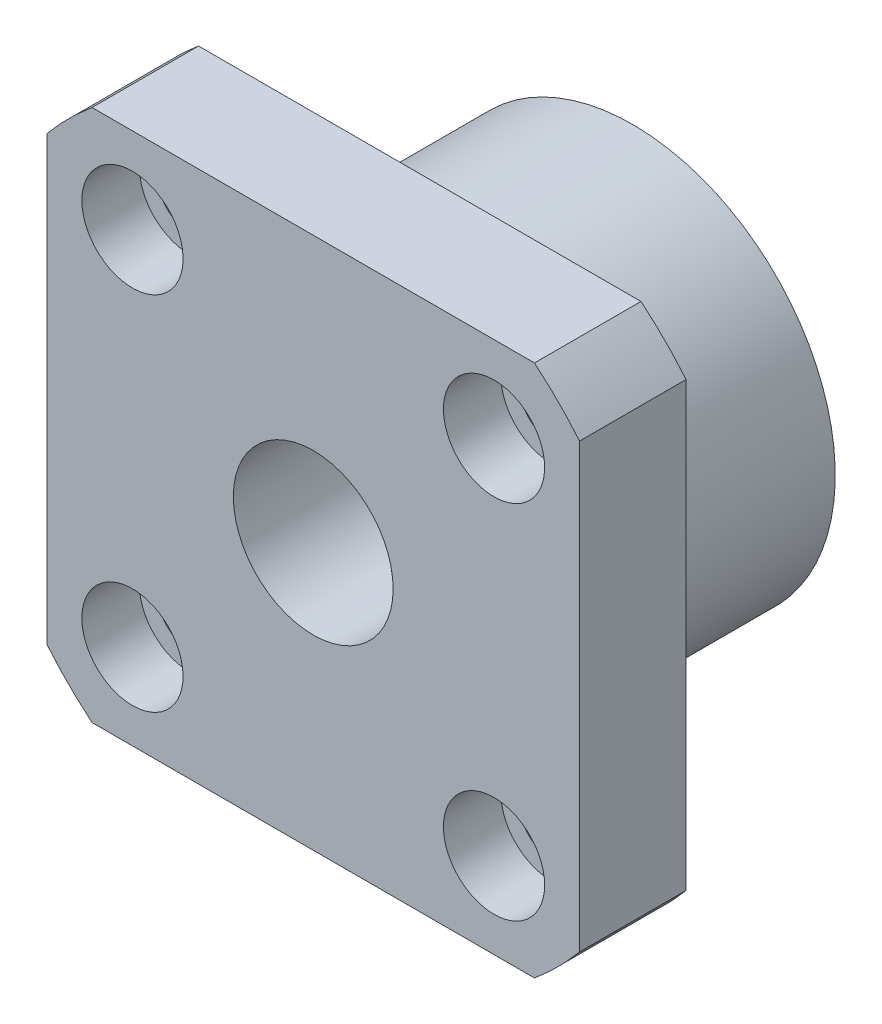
ISO-10303-21;
HEADER;
FILE_DESCRIPTION(('STEP AP214'),'2;1');
FILE_NAME('part.step','',(''),(''),'','','');
FILE_SCHEMA(('AUTOMOTIVE_DESIGN { 1 0 10303 214 1 1 1 1 }'));
ENDSEC;
DATA;
#1=APPLICATION_CONTEXT('core data for automotive mechanical design processes');
#2=APPLICATION_PROTOCOL_DEFINITION('international standard','automotive_design',2000,#1);
#3=PRODUCT_CONTEXT('',#1,'mechanical');
#4=PRODUCT('Part','Part','',(#3));
#5=PRODUCT_RELATED_PRODUCT_CATEGORY('part','',(#4));
#6=PRODUCT_DEFINITION_FORMATION('','',#4);
#7=PRODUCT_DEFINITION_CONTEXT('part definition',#1,'design');
#8=PRODUCT_DEFINITION('design','',#6,#7);
#9=PRODUCT_DEFINITION_SHAPE('','',#8);
#10=(LENGTH_UNIT() NAMED_UNIT(*) SI_UNIT(.MILLI.,.METRE.));
#11=(NAMED_UNIT(*) PLANE_ANGLE_UNIT() SI_UNIT($,.RADIAN.));
#12=(NAMED_UNIT(*) SI_UNIT($,.STERADIAN.) SOLID_ANGLE_UNIT());
#13=UNCERTAINTY_MEASURE_WITH_UNIT(LENGTH_MEASURE(1.E-05),#10,'distance_accuracy_value','');
#14=(GEOMETRIC_REPRESENTATION_CONTEXT(3) GLOBAL_UNCERTAINTY_ASSIGNED_CONTEXT((#13)) GLOBAL_UNIT_ASSIGNED_CONTEXT((#10,
#11,#12)) REPRESENTATION_CONTEXT('',''));
#15=CARTESIAN_POINT('',(0.,0.,0.));
#16=DIRECTION('',(0.,0.,1.));
#17=DIRECTION('',(1.,0.,0.));
#18=AXIS2_PLACEMENT_3D('',#15,#16,#17);
#19=CARTESIAN_POINT('',(0.,0.,0.));
#20=DIRECTION('',(0.,0.,-1.));
#21=DIRECTION('',(-1.,0.,0.));
#22=AXIS2_PLACEMENT_3D('',#19,#20,#21);
#23=PLANE('',#22);
#24=CARTESIAN_POINT('',(-16.9705627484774,-16.9705627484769,0.));
#25=DIRECTION('',(0.,0.,-1.));
#26=DIRECTION('',(0.,-1.,0.));
#27=AXIS2_PLACEMENT_3D('',#24,#25,#26);
#28=CIRCLE('',#27,3.);
#29=CARTESIAN_POINT('',(-16.9705627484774,-19.9705627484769,0.));
#30=VERTEX_POINT('',#29);
#31=EDGE_CURVE('E156',#30,#30,#28,.T.);
#32=ORIENTED_EDGE('',*,*,#31,.F.);
#33=EDGE_LOOP('',(#32));
#34=FACE_BOUND('',#33,.T.);
#35=CARTESIAN_POINT('',(16.9705627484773,16.970562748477,0.));
#36=DIRECTION('',(0.,0.,-1.));
#37=DIRECTION('',(0.,1.,0.));
#38=AXIS2_PLACEMENT_3D('',#35,#36,#37);
#39=CIRCLE('',#38,3.);
#40=CARTESIAN_POINT('',(16.9705627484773,19.970562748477,0.));
#41=VERTEX_POINT('',#40);
#42=EDGE_CURVE('E190',#41,#41,#39,.T.);
#43=ORIENTED_EDGE('',*,*,#42,.F.);
#44=EDGE_LOOP('',(#43));
#45=FACE_BOUND('',#44,.T.);
#46=CARTESIAN_POINT('',(0.,0.,0.));
#47=DIRECTION('',(0.,0.,-1.));
#48=DIRECTION('',(-1.,0.,0.));
#49=AXIS2_PLACEMENT_3D('',#46,#47,#48);
#50=CIRCLE('',#49,32.5);
#51=CARTESIAN_POINT('',(25.,-20.7665596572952,0.));
#52=VERTEX_POINT('',#51);
#53=CARTESIAN_POINT('',(20.7665596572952,-25.,0.));
#54=VERTEX_POINT('',#53);
#55=EDGE_CURVE('E80',#52,#54,#50,.T.);
#56=ORIENTED_EDGE('',*,*,#55,.T.);
#57=DIRECTION('',(1.,0.,0.));
#58=VECTOR('',#57,1.);
#59=CARTESIAN_POINT('',(-20.7665596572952,-25.,0.));
#60=LINE('',#59,#58);
#61=CARTESIAN_POINT('',(-20.7665596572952,-25.,0.));
#62=VERTEX_POINT('',#61);
#63=EDGE_CURVE('E94',#62,#54,#60,.T.);
#64=ORIENTED_EDGE('',*,*,#63,.F.);
#65=CARTESIAN_POINT('',(0.,0.,0.));
#66=DIRECTION('',(0.,0.,1.));
#67=DIRECTION('',(1.,0.,0.));
#68=AXIS2_PLACEMENT_3D('',#65,#66,#67);
#69=CIRCLE('',#68,32.5);
#70=CARTESIAN_POINT('',(-25.,-20.7665596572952,0.));
#71=VERTEX_POINT('',#70);
#72=EDGE_CURVE('E101',#71,#62,#69,.T.);
#73=ORIENTED_EDGE('',*,*,#72,.F.);
#74=DIRECTION('',(0.,-1.,0.));
#75=VECTOR('',#74,1.);
#76=CARTESIAN_POINT('',(-25.,20.7665596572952,0.));
#77=LINE('',#76,#75);
#78=CARTESIAN_POINT('',(-25.,20.7665596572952,0.));
#79=VERTEX_POINT('',#78);
#80=EDGE_CURVE('E103',#79,#71,#77,.T.);
#81=ORIENTED_EDGE('',*,*,#80,.F.);
#82=CARTESIAN_POINT('',(0.,0.,0.));
#83=DIRECTION('',(0.,0.,-1.));
#84=DIRECTION('',(-1.,0.,0.));
#85=AXIS2_PLACEMENT_3D('',#82,#83,#84);
#86=CIRCLE('',#85,32.5);
#87=CARTESIAN_POINT('',(-20.7665596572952,25.,0.));
#88=VERTEX_POINT('',#87);
#89=EDGE_CURVE('E109',#79,#88,#86,.T.);
#90=ORIENTED_EDGE('',*,*,#89,.T.);
#91=DIRECTION('',(1.,0.,0.));
#92=VECTOR('',#91,1.);
#93=CARTESIAN_POINT('',(-20.7665596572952,25.,0.));
#94=LINE('',#93,#92);
#95=CARTESIAN_POINT('',(20.7665596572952,25.,0.));
#96=VERTEX_POINT('',#95);
#97=EDGE_CURVE('E112',#88,#96,#94,.T.);
#98=ORIENTED_EDGE('',*,*,#97,.T.);
#99=CARTESIAN_POINT('',(0.,0.,0.));
#100=DIRECTION('',(0.,0.,1.));
#101=DIRECTION('',(1.,0.,0.));
#102=AXIS2_PLACEMENT_3D('',#99,#100,#101);
#103=CIRCLE('',#102,32.5);
#104=CARTESIAN_POINT('',(25.,20.7665596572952,0.));
#105=VERTEX_POINT('',#104);
#106=EDGE_CURVE('E115',#105,#96,#103,.T.);
#107=ORIENTED_EDGE('',*,*,#106,.F.);
#108=DIRECTION('',(0.,-1.,0.));
#109=VECTOR('',#108,1.);
#110=CARTESIAN_POINT('',(25.,20.7665596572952,0.));
#111=LINE('',#110,#109);
#112=EDGE_CURVE('E97',#105,#52,#111,.T.);
#113=ORIENTED_EDGE('',*,*,#112,.T.);
#114=EDGE_LOOP('',(#56,#64,#73,#81,#90,#98,#107,#113));
#115=FACE_BOUND('',#114,.T.);
#116=CARTESIAN_POINT('',(-16.9705627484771,16.9705627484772,0.));
#117=DIRECTION('',(0.,0.,-1.));
#118=DIRECTION('',(-1.,0.,0.));
#119=AXIS2_PLACEMENT_3D('',#116,#117,#118);
#120=CIRCLE('',#119,3.);
#121=CARTESIAN_POINT('',(-19.970562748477,16.9705627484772,0.));
#122=VERTEX_POINT('',#121);
#123=EDGE_CURVE('E151',#122,#122,#120,.T.);
#124=ORIENTED_EDGE('',*,*,#123,.F.);
#125=EDGE_LOOP('',(#124));
#126=FACE_BOUND('',#125,.T.);
#127=CARTESIAN_POINT('',(16.9705627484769,-16.9705627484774,0.));
#128=DIRECTION('',(0.,0.,-1.));
#129=DIRECTION('',(1.,0.,0.));
#130=AXIS2_PLACEMENT_3D('',#127,#128,#129);
#131=CIRCLE('',#130,3.);
#132=CARTESIAN_POINT('',(19.9705627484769,-16.9705627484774,0.));
#133=VERTEX_POINT('',#132);
#134=EDGE_CURVE('E187',#133,#133,#131,.T.);
#135=ORIENTED_EDGE('',*,*,#134,.F.);
#136=EDGE_LOOP('',(#135));
#137=FACE_BOUND('',#136,.T.);
#138=CARTESIAN_POINT('',(0.,0.,0.));
#139=DIRECTION('',(0.,0.,-1.));
#140=DIRECTION('',(-1.,0.,0.));
#141=AXIS2_PLACEMENT_3D('',#138,#139,#140);
#142=CIRCLE('',#141,19.);
#143=CARTESIAN_POINT('',(-19.,0.,0.));
#144=VERTEX_POINT('',#143);
#145=EDGE_CURVE('E18',#144,#144,#142,.F.);
#146=ORIENTED_EDGE('',*,*,#145,.T.);
#147=EDGE_LOOP('',(#146));
#148=FACE_BOUND('',#147,.T.);
#149=ADVANCED_FACE('F14',(#34,#45,#115,#126,#137,#148),#23,.T.);
#150=CARTESIAN_POINT('',(0.,0.,10.));
#151=DIRECTION('',(0.,0.,-1.));
#152=DIRECTION('',(-1.,0.,0.));
#153=AXIS2_PLACEMENT_3D('',#150,#151,#152);
#154=PLANE('',#153);
#155=CARTESIAN_POINT('',(0.,0.,10.));
#156=DIRECTION('',(0.,0.,1.));
#157=DIRECTION('',(1.,0.,0.));
#158=AXIS2_PLACEMENT_3D('',#155,#156,#157);
#159=CIRCLE('',#158,7.5);
#160=CARTESIAN_POINT('',(7.5,0.,10.));
#161=VERTEX_POINT('',#160);
#162=EDGE_CURVE('E98',#161,#161,#159,.T.);
#163=ORIENTED_EDGE('',*,*,#162,.F.);
#164=EDGE_LOOP('',(#163));
#165=FACE_BOUND('',#164,.T.);
#166=CARTESIAN_POINT('',(-16.9705627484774,-16.9705627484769,10.));
#167=DIRECTION('',(0.,0.,-1.));
#168=DIRECTION('',(0.,-1.,0.));
#169=AXIS2_PLACEMENT_3D('',#166,#167,#168);
#170=CIRCLE('',#169,4.75);
#171=CARTESIAN_POINT('',(-16.9705627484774,-21.7205627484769,10.));
#172=VERTEX_POINT('',#171);
#173=EDGE_CURVE('E171',#172,#172,#170,.T.);
#174=ORIENTED_EDGE('',*,*,#173,.T.);
#175=EDGE_LOOP('',(#174));
#176=FACE_BOUND('',#175,.T.);
#177=CARTESIAN_POINT('',(16.9705627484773,16.970562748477,10.));
#178=DIRECTION('',(0.,0.,-1.));
#179=DIRECTION('',(0.,1.,0.));
#180=AXIS2_PLACEMENT_3D('',#177,#178,#179);
#181=CIRCLE('',#180,4.75);
#182=CARTESIAN_POINT('',(16.9705627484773,21.720562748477,10.));
#183=VERTEX_POINT('',#182);
#184=EDGE_CURVE('E160',#183,#183,#181,.T.);
#185=ORIENTED_EDGE('',*,*,#184,.T.);
#186=EDGE_LOOP('',(#185));
#187=FACE_BOUND('',#186,.T.);
#188=CARTESIAN_POINT('',(-16.9705627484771,16.9705627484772,10.));
#189=DIRECTION('',(0.,0.,-1.));
#190=DIRECTION('',(-1.,0.,0.));
#191=AXIS2_PLACEMENT_3D('',#188,#189,#190);
#192=CIRCLE('',#191,4.75);
#193=CARTESIAN_POINT('',(-21.7205627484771,16.9705627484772,10.));
#194=VERTEX_POINT('',#193);
#195=EDGE_CURVE('E193',#194,#194,#192,.T.);
#196=ORIENTED_EDGE('',*,*,#195,.T.);
#197=EDGE_LOOP('',(#196));
#198=FACE_BOUND('',#197,.T.);
#199=CARTESIAN_POINT('',(0.,0.,10.));
#200=DIRECTION('',(0.,0.,-1.));
#201=DIRECTION('',(-1.,0.,0.));
#202=AXIS2_PLACEMENT_3D('',#199,#200,#201);
#203=CIRCLE('',#202,32.5);
#204=CARTESIAN_POINT('',(25.,-20.7665596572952,10.));
#205=VERTEX_POINT('',#204);
#206=CARTESIAN_POINT('',(20.7665596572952,-25.,10.));
#207=VERTEX_POINT('',#206);
#208=EDGE_CURVE('E82',#205,#207,#203,.T.);
#209=ORIENTED_EDGE('',*,*,#208,.F.);
#210=DIRECTION('',(0.,-1.,0.));
#211=VECTOR('',#210,1.);
#212=CARTESIAN_POINT('',(25.,20.7665596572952,10.));
#213=LINE('',#212,#211);
#214=CARTESIAN_POINT('',(25.,20.7665596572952,10.));
#215=VERTEX_POINT('',#214);
#216=EDGE_CURVE('E88',#215,#205,#213,.T.);
#217=ORIENTED_EDGE('',*,*,#216,.F.);
#218=CARTESIAN_POINT('',(0.,0.,10.));
#219=DIRECTION('',(0.,0.,1.));
#220=DIRECTION('',(1.,0.,0.));
#221=AXIS2_PLACEMENT_3D('',#218,#219,#220);
#222=CIRCLE('',#221,32.5);
#223=CARTESIAN_POINT('',(20.7665596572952,25.,10.));
#224=VERTEX_POINT('',#223);
#225=EDGE_CURVE('E134',#215,#224,#222,.T.);
#226=ORIENTED_EDGE('',*,*,#225,.T.);
#227=DIRECTION('',(1.,0.,0.));
#228=VECTOR('',#227,1.);
#229=CARTESIAN_POINT('',(-20.7665596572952,25.,10.));
#230=LINE('',#229,#228);
#231=CARTESIAN_POINT('',(-20.7665596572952,25.,10.));
#232=VERTEX_POINT('',#231);
#233=EDGE_CURVE('E131',#232,#224,#230,.T.);
#234=ORIENTED_EDGE('',*,*,#233,.F.);
#235=CARTESIAN_POINT('',(0.,0.,10.));
#236=DIRECTION('',(0.,0.,-1.));
#237=DIRECTION('',(-1.,0.,0.));
#238=AXIS2_PLACEMENT_3D('',#235,#236,#237);
#239=CIRCLE('',#238,32.5);
#240=CARTESIAN_POINT('',(-25.,20.7665596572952,10.));
#241=VERTEX_POINT('',#240);
#242=EDGE_CURVE('E128',#241,#232,#239,.T.);
#243=ORIENTED_EDGE('',*,*,#242,.F.);
#244=DIRECTION('',(0.,-1.,0.));
#245=VECTOR('',#244,1.);
#246=CARTESIAN_POINT('',(-25.,20.7665596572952,10.));
#247=LINE('',#246,#245);
#248=CARTESIAN_POINT('',(-25.,-20.7665596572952,10.));
#249=VERTEX_POINT('',#248);
#250=EDGE_CURVE('E125',#241,#249,#247,.T.);
#251=ORIENTED_EDGE('',*,*,#250,.T.);
#252=CARTESIAN_POINT('',(0.,0.,10.));
#253=DIRECTION('',(0.,0.,1.));
#254=DIRECTION('',(1.,0.,0.));
#255=AXIS2_PLACEMENT_3D('',#252,#253,#254);
#256=CIRCLE('',#255,32.5);
#257=CARTESIAN_POINT('',(-20.7665596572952,-25.,10.));
#258=VERTEX_POINT('',#257);
#259=EDGE_CURVE('E122',#249,#258,#256,.T.);
#260=ORIENTED_EDGE('',*,*,#259,.T.);
#261=DIRECTION('',(1.,0.,0.));
#262=VECTOR('',#261,1.);
#263=CARTESIAN_POINT('',(-20.7665596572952,-25.,10.));
#264=LINE('',#263,#262);
#265=EDGE_CURVE('E120',#258,#207,#264,.T.);
#266=ORIENTED_EDGE('',*,*,#265,.T.);
#267=EDGE_LOOP('',(#209,#217,#226,#234,#243,#251,#260,#266));
#268=FACE_BOUND('',#267,.T.);
#269=CARTESIAN_POINT('',(16.9705627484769,-16.9705627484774,10.));
#270=DIRECTION('',(0.,0.,-1.));
#271=DIRECTION('',(1.,0.,0.));
#272=AXIS2_PLACEMENT_3D('',#269,#270,#271);
#273=CIRCLE('',#272,4.75);
#274=CARTESIAN_POINT('',(21.720562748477,-16.9705627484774,10.));
#275=VERTEX_POINT('',#274);
#276=EDGE_CURVE('E164',#275,#275,#273,.T.);
#277=ORIENTED_EDGE('',*,*,#276,.T.);
#278=EDGE_LOOP('',(#277));
#279=FACE_BOUND('',#278,.T.);
#280=ADVANCED_FACE('F205',(#165,#176,#187,#198,#268,#279),#154,.F.);
#281=CARTESIAN_POINT('',(0.,0.,10.));
#282=DIRECTION('',(0.,0.,-1.));
#283=DIRECTION('',(-1.,0.,0.));
#284=AXIS2_PLACEMENT_3D('',#281,#282,#283);
#285=CYLINDRICAL_SURFACE('',#284,32.5);
#286=DIRECTION('',(0.,0.,-1.));
#287=VECTOR('',#286,1.);
#288=CARTESIAN_POINT('',(25.,-20.7665596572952,10.));
#289=LINE('',#288,#287);
#290=EDGE_CURVE('E9',#205,#52,#289,.T.);
#291=ORIENTED_EDGE('',*,*,#290,.F.);
#292=ORIENTED_EDGE('',*,*,#208,.T.);
#293=DIRECTION('',(0.,0.,-1.));
#294=VECTOR('',#293,1.);
#295=CARTESIAN_POINT('',(20.7665596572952,-25.,10.));
#296=LINE('',#295,#294);
#297=EDGE_CURVE('E77',#207,#54,#296,.T.);
#298=ORIENTED_EDGE('',*,*,#297,.T.);
#299=ORIENTED_EDGE('',*,*,#55,.F.);
#300=EDGE_LOOP('',(#291,#292,#298,#299));
#301=FACE_BOUND('',#300,.T.);
#302=ADVANCED_FACE('F79',(#301),#285,.T.);
#303=CARTESIAN_POINT('',(25.,20.7665596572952,10.));
#304=DIRECTION('',(1.,0.,0.));
#305=DIRECTION('',(0.,0.,-1.));
#306=AXIS2_PLACEMENT_3D('',#303,#304,#305);
#307=PLANE('',#306);
#308=DIRECTION('',(0.,0.,-1.));
#309=VECTOR('',#308,1.);
#310=CARTESIAN_POINT('',(25.,20.7665596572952,10.));
#311=LINE('',#310,#309);
#312=EDGE_CURVE('E23',#215,#105,#311,.T.);
#313=ORIENTED_EDGE('',*,*,#312,.F.);
#314=ORIENTED_EDGE('',*,*,#216,.T.);
#315=ORIENTED_EDGE('',*,*,#290,.T.);
#316=ORIENTED_EDGE('',*,*,#112,.F.);
#317=EDGE_LOOP('',(#313,#314,#315,#316));
#318=FACE_BOUND('',#317,.T.);
#319=ADVANCED_FACE('F16',(#318),#307,.T.);
#320=CARTESIAN_POINT('',(0.,0.,10.));
#321=DIRECTION('',(0.,0.,-1.));
#322=DIRECTION('',(-1.,0.,0.));
#323=AXIS2_PLACEMENT_3D('',#320,#321,#322);
#324=CYLINDRICAL_SURFACE('',#323,32.5);
#325=DIRECTION('',(0.,0.,-1.));
#326=VECTOR('',#325,1.);
#327=CARTESIAN_POINT('',(20.7665596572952,25.,10.));
#328=LINE('',#327,#326);
#329=EDGE_CURVE('E145',#224,#96,#328,.T.);
#330=ORIENTED_EDGE('',*,*,#329,.F.);
#331=ORIENTED_EDGE('',*,*,#225,.F.);
#332=ORIENTED_EDGE('',*,*,#312,.T.);
#333=ORIENTED_EDGE('',*,*,#106,.T.);
#334=EDGE_LOOP('',(#330,#331,#332,#333));
#335=FACE_BOUND('',#334,.T.);
#336=ADVANCED_FACE('F269',(#335),#324,.T.);
#337=CARTESIAN_POINT('',(-20.7665596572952,25.,10.));
#338=DIRECTION('',(0.,1.,0.));
#339=DIRECTION('',(0.,0.,1.));
#340=AXIS2_PLACEMENT_3D('',#337,#338,#339);
#341=PLANE('',#340);
#342=DIRECTION('',(0.,0.,-1.));
#343=VECTOR('',#342,1.);
#344=CARTESIAN_POINT('',(-20.7665596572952,25.,10.));
#345=LINE('',#344,#343);
#346=EDGE_CURVE('E143',#232,#88,#345,.T.);
#347=ORIENTED_EDGE('',*,*,#346,.F.);
#348=ORIENTED_EDGE('',*,*,#233,.T.);
#349=ORIENTED_EDGE('',*,*,#329,.T.);
#350=ORIENTED_EDGE('',*,*,#97,.F.);
#351=EDGE_LOOP('',(#347,#348,#349,#350));
#352=FACE_BOUND('',#351,.T.);
#353=ADVANCED_FACE('F266',(#352),#341,.T.);
#354=CARTESIAN_POINT('',(0.,0.,10.));
#355=DIRECTION('',(0.,0.,-1.));
#356=DIRECTION('',(-1.,0.,0.));
#357=AXIS2_PLACEMENT_3D('',#354,#355,#356);
#358=CYLINDRICAL_SURFACE('',#357,32.5);
#359=DIRECTION('',(0.,0.,-1.));
#360=VECTOR('',#359,1.);
#361=CARTESIAN_POINT('',(-25.,20.7665596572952,10.));
#362=LINE('',#361,#360);
#363=EDGE_CURVE('E141',#241,#79,#362,.T.);
#364=ORIENTED_EDGE('',*,*,#363,.F.);
#365=ORIENTED_EDGE('',*,*,#242,.T.);
#366=ORIENTED_EDGE('',*,*,#346,.T.);
#367=ORIENTED_EDGE('',*,*,#89,.F.);
#368=EDGE_LOOP('',(#364,#365,#366,#367));
#369=FACE_BOUND('',#368,.T.);
#370=ADVANCED_FACE('F262',(#369),#358,.T.);
#371=CARTESIAN_POINT('',(-25.,20.7665596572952,10.));
#372=DIRECTION('',(1.,0.,0.));
#373=DIRECTION('',(0.,0.,-1.));
#374=AXIS2_PLACEMENT_3D('',#371,#372,#373);
#375=PLANE('',#374);
#376=DIRECTION('',(0.,0.,-1.));
#377=VECTOR('',#376,1.);
#378=CARTESIAN_POINT('',(-25.,-20.7665596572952,10.));
#379=LINE('',#378,#377);
#380=EDGE_CURVE('E139',#249,#71,#379,.T.);
#381=ORIENTED_EDGE('',*,*,#380,.F.);
#382=ORIENTED_EDGE('',*,*,#250,.F.);
#383=ORIENTED_EDGE('',*,*,#363,.T.);
#384=ORIENTED_EDGE('',*,*,#80,.T.);
#385=EDGE_LOOP('',(#381,#382,#383,#384));
#386=FACE_BOUND('',#385,.T.);
#387=ADVANCED_FACE('F258',(#386),#375,.F.);
#388=CARTESIAN_POINT('',(0.,0.,10.));
#389=DIRECTION('',(0.,0.,-1.));
#390=DIRECTION('',(-1.,0.,0.));
#391=AXIS2_PLACEMENT_3D('',#388,#389,#390);
#392=CYLINDRICAL_SURFACE('',#391,32.5);
#393=DIRECTION('',(0.,0.,-1.));
#394=VECTOR('',#393,1.);
#395=CARTESIAN_POINT('',(-20.7665596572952,-25.,10.));
#396=LINE('',#395,#394);
#397=EDGE_CURVE('E87',#258,#62,#396,.T.);
#398=ORIENTED_EDGE('',*,*,#397,.F.);
#399=ORIENTED_EDGE('',*,*,#259,.F.);
#400=ORIENTED_EDGE('',*,*,#380,.T.);
#401=ORIENTED_EDGE('',*,*,#72,.T.);
#402=EDGE_LOOP('',(#398,#399,#400,#401));
#403=FACE_BOUND('',#402,.T.);
#404=ADVANCED_FACE('F255',(#403),#392,.T.);
#405=CARTESIAN_POINT('',(-20.7665596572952,-25.,10.));
#406=DIRECTION('',(0.,1.,0.));
#407=DIRECTION('',(0.,0.,1.));
#408=AXIS2_PLACEMENT_3D('',#405,#406,#407);
#409=PLANE('',#408);
#410=ORIENTED_EDGE('',*,*,#265,.F.);
#411=ORIENTED_EDGE('',*,*,#397,.T.);
#412=ORIENTED_EDGE('',*,*,#63,.T.);
#413=ORIENTED_EDGE('',*,*,#297,.F.);
#414=EDGE_LOOP('',(#410,#411,#412,#413));
#415=FACE_BOUND('',#414,.T.);
#416=ADVANCED_FACE('F100',(#415),#409,.F.);
#417=CARTESIAN_POINT('',(0.,0.,10.));
#418=DIRECTION('',(0.,0.,-1.));
#419=DIRECTION('',(-1.,0.,0.));
#420=AXIS2_PLACEMENT_3D('',#417,#418,#419);
#421=CYLINDRICAL_SURFACE('',#420,7.5);
#422=ORIENTED_EDGE('',*,*,#162,.T.);
#423=EDGE_LOOP('',(#422));
#424=FACE_BOUND('',#423,.T.);
#425=CARTESIAN_POINT('',(0.,0.,-20.));
#426=DIRECTION('',(0.,0.,-1.));
#427=DIRECTION('',(-1.,0.,0.));
#428=AXIS2_PLACEMENT_3D('',#425,#426,#427);
#429=CIRCLE('',#428,7.5);
#430=CARTESIAN_POINT('',(-7.5,0.,-20.));
#431=VERTEX_POINT('',#430);
#432=EDGE_CURVE('E475',#431,#431,#429,.T.);
#433=ORIENTED_EDGE('',*,*,#432,.T.);
#434=EDGE_LOOP('',(#433));
#435=FACE_BOUND('',#434,.T.);
#436=ADVANCED_FACE('F202',(#424,#435),#421,.F.);
#437=CARTESIAN_POINT('',(-16.9705627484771,16.9705627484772,0.));
#438=DIRECTION('',(0.,0.,1.));
#439=DIRECTION('',(1.,0.,0.));
#440=AXIS2_PLACEMENT_3D('',#437,#438,#439);
#441=CYLINDRICAL_SURFACE('',#440,3.);
#442=CARTESIAN_POINT('',(-16.9705627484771,16.9705627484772,4.6));
#443=DIRECTION('',(0.,0.,-1.));
#444=DIRECTION('',(-1.,0.,0.));
#445=AXIS2_PLACEMENT_3D('',#442,#443,#444);
#446=CIRCLE('',#445,3.);
#447=CARTESIAN_POINT('',(-19.970562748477,16.9705627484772,4.6));
#448=VERTEX_POINT('',#447);
#449=EDGE_CURVE('E148',#448,#448,#446,.T.);
#450=ORIENTED_EDGE('',*,*,#449,.F.);
#451=EDGE_LOOP('',(#450));
#452=FACE_BOUND('',#451,.T.);
#453=ORIENTED_EDGE('',*,*,#123,.T.);
#454=EDGE_LOOP('',(#453));
#455=FACE_BOUND('',#454,.T.);
#456=ADVANCED_FACE('F351',(#452,#455),#441,.F.);
#457=CARTESIAN_POINT('',(-16.9705627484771,16.9705627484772,4.6));
#458=DIRECTION('',(0.,0.,1.));
#459=DIRECTION('',(1.,0.,0.));
#460=AXIS2_PLACEMENT_3D('',#457,#458,#459);
#461=CYLINDRICAL_SURFACE('',#460,4.75);
#462=CARTESIAN_POINT('',(-16.9705627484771,16.9705627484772,4.6));
#463=DIRECTION('',(0.,0.,-1.));
#464=DIRECTION('',(-1.,0.,0.));
#465=AXIS2_PLACEMENT_3D('',#462,#463,#464);
#466=CIRCLE('',#465,4.75);
#467=CARTESIAN_POINT('',(-21.7205627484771,16.9705627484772,4.6));
#468=VERTEX_POINT('',#467);
#469=EDGE_CURVE('E152',#468,#468,#466,.T.);
#470=ORIENTED_EDGE('',*,*,#469,.T.);
#471=EDGE_LOOP('',(#470));
#472=FACE_BOUND('',#471,.T.);
#473=ORIENTED_EDGE('',*,*,#195,.F.);
#474=EDGE_LOOP('',(#473));
#475=FACE_BOUND('',#474,.T.);
#476=ADVANCED_FACE('F358',(#472,#475),#461,.F.);
#477=CARTESIAN_POINT('',(-16.9705627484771,16.9705627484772,4.6));
#478=DIRECTION('',(0.,0.,-1.));
#479=DIRECTION('',(-1.,0.,0.));
#480=AXIS2_PLACEMENT_3D('',#477,#478,#479);
#481=PLANE('',#480);
#482=ORIENTED_EDGE('',*,*,#449,.T.);
#483=EDGE_LOOP('',(#482));
#484=FACE_BOUND('',#483,.T.);
#485=ORIENTED_EDGE('',*,*,#469,.F.);
#486=EDGE_LOOP('',(#485));
#487=FACE_BOUND('',#486,.T.);
#488=ADVANCED_FACE('F360',(#484,#487),#481,.F.);
#489=CARTESIAN_POINT('',(16.9705627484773,16.970562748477,0.));
#490=DIRECTION('',(0.,0.,1.));
#491=DIRECTION('',(1.,0.,0.));
#492=AXIS2_PLACEMENT_3D('',#489,#490,#491);
#493=CYLINDRICAL_SURFACE('',#492,3.);
#494=CARTESIAN_POINT('',(16.9705627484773,16.970562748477,4.6));
#495=DIRECTION('',(0.,0.,-1.));
#496=DIRECTION('',(-1.,0.,0.));
#497=AXIS2_PLACEMENT_3D('',#494,#495,#496);
#498=CIRCLE('',#497,3.);
#499=CARTESIAN_POINT('',(13.9705627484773,16.970562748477,4.6));
#500=VERTEX_POINT('',#499);
#501=EDGE_CURVE('E153',#500,#500,#498,.T.);
#502=ORIENTED_EDGE('',*,*,#501,.F.);
#503=EDGE_LOOP('',(#502));
#504=FACE_BOUND('',#503,.T.);
#505=ORIENTED_EDGE('',*,*,#42,.T.);
#506=EDGE_LOOP('',(#505));
#507=FACE_BOUND('',#506,.T.);
#508=ADVANCED_FACE('F369',(#504,#507),#493,.F.);
#509=CARTESIAN_POINT('',(16.9705627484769,-16.9705627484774,0.));
#510=DIRECTION('',(0.,0.,1.));
#511=DIRECTION('',(1.,0.,0.));
#512=AXIS2_PLACEMENT_3D('',#509,#510,#511);
#513=CYLINDRICAL_SURFACE('',#512,3.);
#514=CARTESIAN_POINT('',(16.9705627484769,-16.9705627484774,4.6));
#515=DIRECTION('',(0.,0.,-1.));
#516=DIRECTION('',(-1.,0.,0.));
#517=AXIS2_PLACEMENT_3D('',#514,#515,#516);
#518=CIRCLE('',#517,3.);
#519=CARTESIAN_POINT('',(13.9705627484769,-16.9705627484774,4.6));
#520=VERTEX_POINT('',#519);
#521=EDGE_CURVE('E158',#520,#520,#518,.T.);
#522=ORIENTED_EDGE('',*,*,#521,.F.);
#523=EDGE_LOOP('',(#522));
#524=FACE_BOUND('',#523,.T.);
#525=ORIENTED_EDGE('',*,*,#134,.T.);
#526=EDGE_LOOP('',(#525));
#527=FACE_BOUND('',#526,.T.);
#528=ADVANCED_FACE('F384',(#524,#527),#513,.F.);
#529=CARTESIAN_POINT('',(-16.9705627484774,-16.9705627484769,0.));
#530=DIRECTION('',(0.,0.,1.));
#531=DIRECTION('',(1.,0.,0.));
#532=AXIS2_PLACEMENT_3D('',#529,#530,#531);
#533=CYLINDRICAL_SURFACE('',#532,3.);
#534=CARTESIAN_POINT('',(-16.9705627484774,-16.9705627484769,4.6));
#535=DIRECTION('',(0.,0.,-1.));
#536=DIRECTION('',(-1.,0.,0.));
#537=AXIS2_PLACEMENT_3D('',#534,#535,#536);
#538=CIRCLE('',#537,3.);
#539=CARTESIAN_POINT('',(-19.9705627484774,-16.9705627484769,4.6));
#540=VERTEX_POINT('',#539);
#541=EDGE_CURVE('E162',#540,#540,#538,.T.);
#542=ORIENTED_EDGE('',*,*,#541,.F.);
#543=EDGE_LOOP('',(#542));
#544=FACE_BOUND('',#543,.T.);
#545=ORIENTED_EDGE('',*,*,#31,.T.);
#546=EDGE_LOOP('',(#545));
#547=FACE_BOUND('',#546,.T.);
#548=ADVANCED_FACE('F237',(#544,#547),#533,.F.);
#549=CARTESIAN_POINT('',(16.9705627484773,16.970562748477,4.6));
#550=DIRECTION('',(0.,0.,1.));
#551=DIRECTION('',(1.,0.,0.));
#552=AXIS2_PLACEMENT_3D('',#549,#550,#551);
#553=CYLINDRICAL_SURFACE('',#552,4.75);
#554=CARTESIAN_POINT('',(16.9705627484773,16.970562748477,4.6));
#555=DIRECTION('',(0.,0.,-1.));
#556=DIRECTION('',(0.,1.,0.));
#557=AXIS2_PLACEMENT_3D('',#554,#555,#556);
#558=CIRCLE('',#557,4.75);
#559=CARTESIAN_POINT('',(16.9705627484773,21.720562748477,4.6));
#560=VERTEX_POINT('',#559);
#561=EDGE_CURVE('E157',#560,#560,#558,.T.);
#562=ORIENTED_EDGE('',*,*,#561,.T.);
#563=EDGE_LOOP('',(#562));
#564=FACE_BOUND('',#563,.T.);
#565=ORIENTED_EDGE('',*,*,#184,.F.);
#566=EDGE_LOOP('',(#565));
#567=FACE_BOUND('',#566,.T.);
#568=ADVANCED_FACE('F234',(#564,#567),#553,.F.);
#569=CARTESIAN_POINT('',(16.9705627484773,16.970562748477,4.6));
#570=DIRECTION('',(0.,0.,-1.));
#571=DIRECTION('',(0.,1.,0.));
#572=AXIS2_PLACEMENT_3D('',#569,#570,#571);
#573=PLANE('',#572);
#574=ORIENTED_EDGE('',*,*,#501,.T.);
#575=EDGE_LOOP('',(#574));
#576=FACE_BOUND('',#575,.T.);
#577=ORIENTED_EDGE('',*,*,#561,.F.);
#578=EDGE_LOOP('',(#577));
#579=FACE_BOUND('',#578,.T.);
#580=ADVANCED_FACE('F222',(#576,#579),#573,.F.);
#581=CARTESIAN_POINT('',(16.9705627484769,-16.9705627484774,4.6));
#582=DIRECTION('',(0.,0.,1.));
#583=DIRECTION('',(1.,0.,0.));
#584=AXIS2_PLACEMENT_3D('',#581,#582,#583);
#585=CYLINDRICAL_SURFACE('',#584,4.75);
#586=CARTESIAN_POINT('',(16.9705627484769,-16.9705627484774,4.6));
#587=DIRECTION('',(0.,0.,-1.));
#588=DIRECTION('',(1.,0.,0.));
#589=AXIS2_PLACEMENT_3D('',#586,#587,#588);
#590=CIRCLE('',#589,4.75);
#591=CARTESIAN_POINT('',(21.720562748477,-16.9705627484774,4.6));
#592=VERTEX_POINT('',#591);
#593=EDGE_CURVE('E161',#592,#592,#590,.T.);
#594=ORIENTED_EDGE('',*,*,#593,.T.);
#595=EDGE_LOOP('',(#594));
#596=FACE_BOUND('',#595,.T.);
#597=ORIENTED_EDGE('',*,*,#276,.F.);
#598=EDGE_LOOP('',(#597));
#599=FACE_BOUND('',#598,.T.);
#600=ADVANCED_FACE('F219',(#596,#599),#585,.F.);
#601=CARTESIAN_POINT('',(16.9705627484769,-16.9705627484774,4.6));
#602=DIRECTION('',(0.,0.,-1.));
#603=DIRECTION('',(1.,0.,0.));
#604=AXIS2_PLACEMENT_3D('',#601,#602,#603);
#605=PLANE('',#604);
#606=ORIENTED_EDGE('',*,*,#521,.T.);
#607=EDGE_LOOP('',(#606));
#608=FACE_BOUND('',#607,.T.);
#609=ORIENTED_EDGE('',*,*,#593,.F.);
#610=EDGE_LOOP('',(#609));
#611=FACE_BOUND('',#610,.T.);
#612=ADVANCED_FACE('F221',(#608,#611),#605,.F.);
#613=CARTESIAN_POINT('',(-16.9705627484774,-16.9705627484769,4.6));
#614=DIRECTION('',(0.,0.,1.));
#615=DIRECTION('',(1.,0.,0.));
#616=AXIS2_PLACEMENT_3D('',#613,#614,#615);
#617=CYLINDRICAL_SURFACE('',#616,4.75);
#618=CARTESIAN_POINT('',(-16.9705627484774,-16.9705627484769,4.6));
#619=DIRECTION('',(0.,0.,-1.));
#620=DIRECTION('',(0.,-1.,0.));
#621=AXIS2_PLACEMENT_3D('',#618,#619,#620);
#622=CIRCLE('',#621,4.75);
#623=CARTESIAN_POINT('',(-16.9705627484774,-21.7205627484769,4.6));
#624=VERTEX_POINT('',#623);
#625=EDGE_CURVE('E165',#624,#624,#622,.T.);
#626=ORIENTED_EDGE('',*,*,#625,.T.);
#627=EDGE_LOOP('',(#626));
#628=FACE_BOUND('',#627,.T.);
#629=ORIENTED_EDGE('',*,*,#173,.F.);
#630=EDGE_LOOP('',(#629));
#631=FACE_BOUND('',#630,.T.);
#632=ADVANCED_FACE('F231',(#628,#631),#617,.F.);
#633=CARTESIAN_POINT('',(-16.9705627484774,-16.9705627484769,4.6));
#634=DIRECTION('',(0.,0.,-1.));
#635=DIRECTION('',(0.,-1.,0.));
#636=AXIS2_PLACEMENT_3D('',#633,#634,#635);
#637=PLANE('',#636);
#638=ORIENTED_EDGE('',*,*,#541,.T.);
#639=EDGE_LOOP('',(#638));
#640=FACE_BOUND('',#639,.T.);
#641=ORIENTED_EDGE('',*,*,#625,.F.);
#642=EDGE_LOOP('',(#641));
#643=FACE_BOUND('',#642,.T.);
#644=ADVANCED_FACE('F225',(#640,#643),#637,.F.);
#645=CARTESIAN_POINT('',(0.,0.,-20.));
#646=DIRECTION('',(0.,0.,-1.));
#647=DIRECTION('',(-1.,0.,0.));
#648=AXIS2_PLACEMENT_3D('',#645,#646,#647);
#649=PLANE('',#648);
#650=CARTESIAN_POINT('',(0.,0.,-20.));
#651=DIRECTION('',(0.,0.,-1.));
#652=DIRECTION('',(-1.,0.,0.));
#653=AXIS2_PLACEMENT_3D('',#650,#651,#652);
#654=CIRCLE('',#653,19.);
#655=CARTESIAN_POINT('',(-19.,0.,-20.));
#656=VERTEX_POINT('',#655);
#657=EDGE_CURVE('E474',#656,#656,#654,.T.);
#658=ORIENTED_EDGE('',*,*,#657,.T.);
#659=EDGE_LOOP('',(#658));
#660=FACE_BOUND('',#659,.T.);
#661=ORIENTED_EDGE('',*,*,#432,.F.);
#662=EDGE_LOOP('',(#661));
#663=FACE_BOUND('',#662,.T.);
#664=ADVANCED_FACE('F239',(#660,#663),#649,.T.);
#665=CARTESIAN_POINT('',(0.,0.,-20.));
#666=DIRECTION('',(0.,0.,1.));
#667=DIRECTION('',(1.,0.,0.));
#668=AXIS2_PLACEMENT_3D('',#665,#666,#667);
#669=CYLINDRICAL_SURFACE('',#668,19.);
#670=ORIENTED_EDGE('',*,*,#145,.F.);
#671=EDGE_LOOP('',(#670));
#672=FACE_BOUND('',#671,.T.);
#673=ORIENTED_EDGE('',*,*,#657,.F.);
#674=EDGE_LOOP('',(#673));
#675=FACE_BOUND('',#674,.T.);
#676=ADVANCED_FACE('F426',(#672,#675),#669,.T.);
#677=CLOSED_SHELL('',(#149,#280,#302,#319,#336,#353,#370,#387,#404,#416,#436,#456,#476,#488,
#508,#528,#548,#568,#580,#600,#612,#632,#644,#664,#676));
#678=MANIFOLD_SOLID_BREP('B1',#677);
#679=ADVANCED_BREP_SHAPE_REPRESENTATION('',(#18,#678),#14);
#680=SHAPE_DEFINITION_REPRESENTATION(#9,#679);
ENDSEC;
END-ISO-10303-21;
